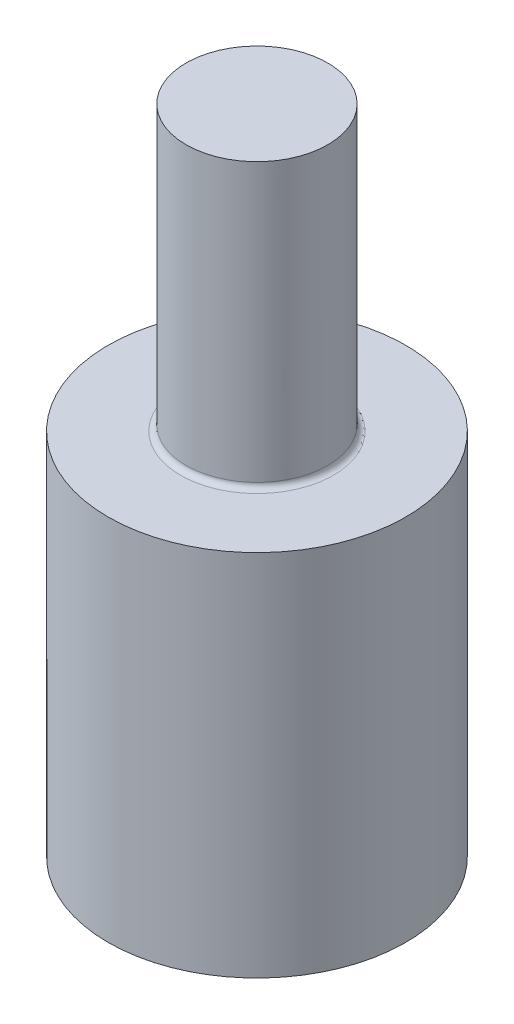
ISO-10303-21;
HEADER;
FILE_DESCRIPTION(('STEP AP214'),'2;1');
FILE_NAME('part.step','',(''),(''),'','','');
FILE_SCHEMA(('AUTOMOTIVE_DESIGN { 1 0 10303 214 1 1 1 1 }'));
ENDSEC;
DATA;
#1=APPLICATION_CONTEXT('core data for automotive mechanical design processes');
#2=APPLICATION_PROTOCOL_DEFINITION('international standard','automotive_design',2000,#1);
#3=PRODUCT_CONTEXT('',#1,'mechanical');
#4=PRODUCT('Part','Part','',(#3));
#5=PRODUCT_RELATED_PRODUCT_CATEGORY('part','',(#4));
#6=PRODUCT_DEFINITION_FORMATION('','',#4);
#7=PRODUCT_DEFINITION_CONTEXT('part definition',#1,'design');
#8=PRODUCT_DEFINITION('design','',#6,#7);
#9=PRODUCT_DEFINITION_SHAPE('','',#8);
#10=(LENGTH_UNIT() NAMED_UNIT(*) SI_UNIT(.MILLI.,.METRE.));
#11=(NAMED_UNIT(*) PLANE_ANGLE_UNIT() SI_UNIT($,.RADIAN.));
#12=(NAMED_UNIT(*) SI_UNIT($,.STERADIAN.) SOLID_ANGLE_UNIT());
#13=UNCERTAINTY_MEASURE_WITH_UNIT(LENGTH_MEASURE(1.E-05),#10,'distance_accuracy_value','');
#14=(GEOMETRIC_REPRESENTATION_CONTEXT(3) GLOBAL_UNCERTAINTY_ASSIGNED_CONTEXT((#13)) GLOBAL_UNIT_ASSIGNED_CONTEXT((#10,
#11,#12)) REPRESENTATION_CONTEXT('',''));
#15=CARTESIAN_POINT('',(0.,0.,0.));
#16=DIRECTION('',(0.,0.,1.));
#17=DIRECTION('',(1.,0.,0.));
#18=AXIS2_PLACEMENT_3D('',#15,#16,#17);
#19=CARTESIAN_POINT('',(0.,17.,0.));
#20=DIRECTION('',(0.,1.,0.));
#21=DIRECTION('',(0.353541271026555,0.,0.935418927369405));
#22=AXIS2_PLACEMENT_3D('',#19,#20,#21);
#23=CYLINDRICAL_SURFACE('',#22,2.5);
#24=CARTESIAN_POINT('',(0.,7.2,0.));
#25=DIRECTION('',(0.,-1.,0.));
#26=DIRECTION('',(-0.353541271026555,0.,-0.935418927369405));
#27=AXIS2_PLACEMENT_3D('',#24,#25,#26);
#28=CIRCLE('',#27,2.5);
#29=CARTESIAN_POINT('',(-0.883853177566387,7.2,-2.33854731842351));
#30=VERTEX_POINT('',#29);
#31=EDGE_CURVE('E21',#30,#30,#28,.F.);
#32=ORIENTED_EDGE('',*,*,#31,.T.);
#33=EDGE_LOOP('',(#32));
#34=FACE_BOUND('',#33,.T.);
#35=CARTESIAN_POINT('',(0.,17.,0.));
#36=DIRECTION('',(0.,1.,0.));
#37=DIRECTION('',(0.,0.,1.));
#38=AXIS2_PLACEMENT_3D('',#35,#36,#37);
#39=CIRCLE('',#38,2.5);
#40=CARTESIAN_POINT('',(0.,17.,2.5));
#41=VERTEX_POINT('',#40);
#42=EDGE_CURVE('E25',#41,#41,#39,.T.);
#43=ORIENTED_EDGE('',*,*,#42,.F.);
#44=EDGE_LOOP('',(#43));
#45=FACE_BOUND('',#44,.T.);
#46=ADVANCED_FACE('F14',(#34,#45),#23,.T.);
#47=CARTESIAN_POINT('',(2.33854731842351,7.,-0.883853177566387));
#48=DIRECTION('',(0.,-1.,0.));
#49=DIRECTION('',(-0.353541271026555,0.,-0.935418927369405));
#50=AXIS2_PLACEMENT_3D('',#47,#48,#49);
#51=PLANE('',#50);
#52=CARTESIAN_POINT('',(0.,7.,0.));
#53=DIRECTION('',(0.,-1.,0.));
#54=DIRECTION('',(-0.353541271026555,0.,-0.935418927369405));
#55=AXIS2_PLACEMENT_3D('',#52,#53,#54);
#56=CIRCLE('',#55,2.7);
#57=CARTESIAN_POINT('',(-0.954561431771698,7.,-2.52563110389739));
#58=VERTEX_POINT('',#57);
#59=EDGE_CURVE('E10',#58,#58,#56,.T.);
#60=ORIENTED_EDGE('',*,*,#59,.T.);
#61=EDGE_LOOP('',(#60));
#62=FACE_BOUND('',#61,.T.);
#63=CARTESIAN_POINT('',(0.,7.,0.));
#64=DIRECTION('',(0.,1.,0.));
#65=DIRECTION('',(0.,0.,1.));
#66=AXIS2_PLACEMENT_3D('',#63,#64,#65);
#67=CIRCLE('',#66,5.25);
#68=CARTESIAN_POINT('',(0.,7.,5.25));
#69=VERTEX_POINT('',#68);
#70=EDGE_CURVE('E29',#69,#69,#67,.T.);
#71=ORIENTED_EDGE('',*,*,#70,.T.);
#72=EDGE_LOOP('',(#71));
#73=FACE_BOUND('',#72,.T.);
#74=ADVANCED_FACE('F51',(#62,#73),#51,.F.);
#75=CARTESIAN_POINT('',(0.,7.2,0.));
#76=DIRECTION('',(0.,-1.,0.));
#77=DIRECTION('',(-0.353541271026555,0.,-0.935418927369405));
#78=AXIS2_PLACEMENT_3D('',#75,#76,#77);
#79=TOROIDAL_SURFACE('',#78,2.7,0.2);
#80=ORIENTED_EDGE('',*,*,#59,.F.);
#81=EDGE_LOOP('',(#80));
#82=FACE_BOUND('',#81,.T.);
#83=ORIENTED_EDGE('',*,*,#31,.F.);
#84=EDGE_LOOP('',(#83));
#85=FACE_BOUND('',#84,.T.);
#86=ADVANCED_FACE('F16',(#82,#85),#79,.F.);
#87=CARTESIAN_POINT('',(0.,17.,0.));
#88=DIRECTION('',(0.,-1.,0.));
#89=DIRECTION('',(-0.353541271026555,0.,-0.935418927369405));
#90=AXIS2_PLACEMENT_3D('',#87,#88,#89);
#91=PLANE('',#90);
#92=ORIENTED_EDGE('',*,*,#42,.T.);
#93=EDGE_LOOP('',(#92));
#94=FACE_BOUND('',#93,.T.);
#95=ADVANCED_FACE('F48',(#94),#91,.F.);
#96=CARTESIAN_POINT('',(0.,17.,0.));
#97=DIRECTION('',(0.,1.,0.));
#98=DIRECTION('',(0.353541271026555,0.,0.935418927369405));
#99=AXIS2_PLACEMENT_3D('',#96,#97,#98);
#100=CYLINDRICAL_SURFACE('',#99,5.25);
#101=CARTESIAN_POINT('',(0.,-6.,0.));
#102=DIRECTION('',(0.,1.,0.));
#103=DIRECTION('',(0.,0.,1.));
#104=AXIS2_PLACEMENT_3D('',#101,#102,#103);
#105=CIRCLE('',#104,5.25);
#106=CARTESIAN_POINT('',(0.,-6.,5.25));
#107=VERTEX_POINT('',#106);
#108=EDGE_CURVE('E34',#107,#107,#105,.T.);
#109=ORIENTED_EDGE('',*,*,#108,.T.);
#110=EDGE_LOOP('',(#109));
#111=FACE_BOUND('',#110,.T.);
#112=ORIENTED_EDGE('',*,*,#70,.F.);
#113=EDGE_LOOP('',(#112));
#114=FACE_BOUND('',#113,.T.);
#115=ADVANCED_FACE('F38',(#111,#114),#100,.T.);
#116=CARTESIAN_POINT('',(4.91094936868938,-6.,-1.85609167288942));
#117=DIRECTION('',(0.,1.,0.));
#118=DIRECTION('',(0.353541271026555,0.,0.935418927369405));
#119=AXIS2_PLACEMENT_3D('',#116,#117,#118);
#120=PLANE('',#119);
#121=ORIENTED_EDGE('',*,*,#108,.F.);
#122=EDGE_LOOP('',(#121));
#123=FACE_BOUND('',#122,.T.);
#124=ADVANCED_FACE('F41',(#123),#120,.F.);
#125=CLOSED_SHELL('',(#46,#74,#86,#95,#115,#124));
#126=MANIFOLD_SOLID_BREP('B1',#125);
#127=ADVANCED_BREP_SHAPE_REPRESENTATION('',(#18,#126),#14);
#128=SHAPE_DEFINITION_REPRESENTATION(#9,#127);
ENDSEC;
END-ISO-10303-21;
